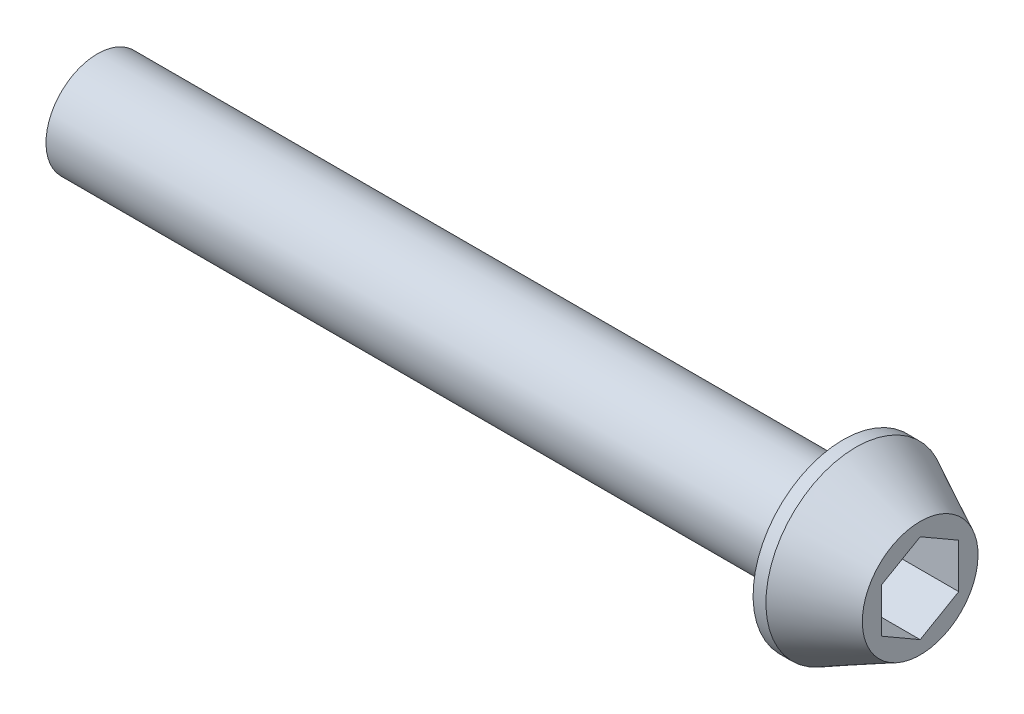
from build123d import *

# Parameters (mm, degrees)
CORTAR_EXTRUIR1_DEPTH = 5


with BuildPart() as part:
    # Croquis1 → Revoluci_n1 (revolve)
    with BuildSketch(Plane.XY):
        Polygon((0, 4.5), (0, 0), (-6, 0), (-6, 3), (-64, 3), (-64, 4), (-6, 4), (-6, 7), (-5, 7), align=None)
    revolve(axis=Axis((0, 0, 0), (-1, 0, 0)))

    # Croquis2 → Cortar-Extruir1 (cut)
    with BuildSketch(Plane(origin=(0, 0, 0), x_dir=(0, 0, -1), z_dir=(1, 0, 0))):
        Polygon((0, 3.464101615), (-3, 1.732050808), (-3, -1.732050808), (0, -3.464101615), (3, -1.732050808), (3, 1.732050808), align=None)
    extrude(amount=-CORTAR_EXTRUIR1_DEPTH, mode=Mode.SUBTRACT)


solid = part.part
